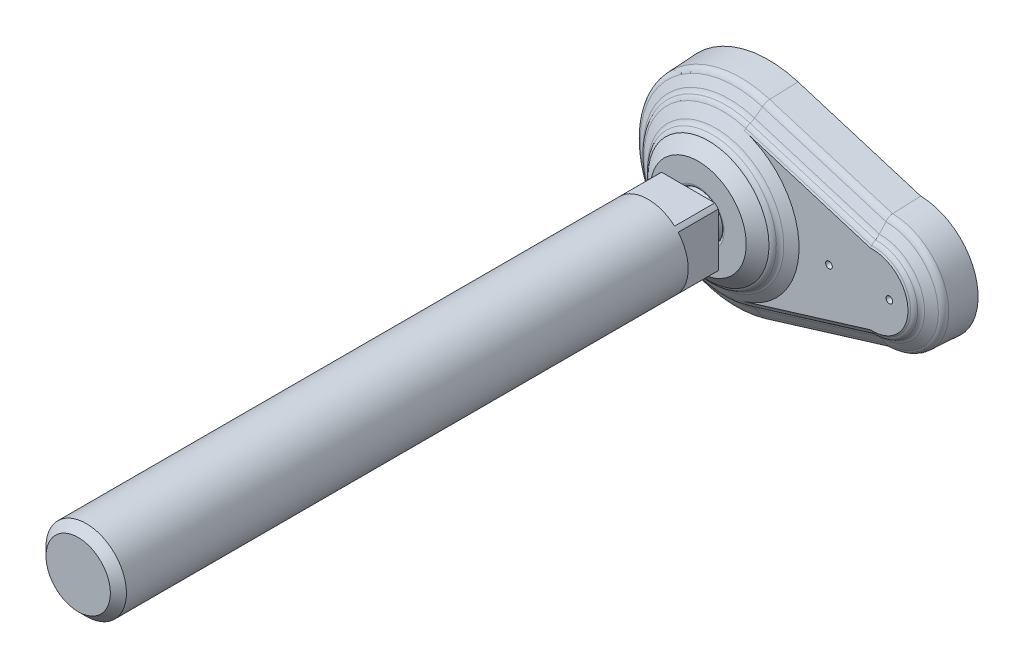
ISO-10303-21;
HEADER;
FILE_DESCRIPTION(('STEP AP214'),'2;1');
FILE_NAME('part.step','',(''),(''),'','','');
FILE_SCHEMA(('AUTOMOTIVE_DESIGN { 1 0 10303 214 1 1 1 1 }'));
ENDSEC;
DATA;
#1=APPLICATION_CONTEXT('core data for automotive mechanical design processes');
#2=APPLICATION_PROTOCOL_DEFINITION('international standard','automotive_design',2000,#1);
#3=PRODUCT_CONTEXT('',#1,'mechanical');
#4=PRODUCT('Part','Part','',(#3));
#5=PRODUCT_RELATED_PRODUCT_CATEGORY('part','',(#4));
#6=PRODUCT_DEFINITION_FORMATION('','',#4);
#7=PRODUCT_DEFINITION_CONTEXT('part definition',#1,'design');
#8=PRODUCT_DEFINITION('design','',#6,#7);
#9=PRODUCT_DEFINITION_SHAPE('','',#8);
#10=(LENGTH_UNIT() NAMED_UNIT(*) SI_UNIT(.MILLI.,.METRE.));
#11=(NAMED_UNIT(*) PLANE_ANGLE_UNIT() SI_UNIT($,.RADIAN.));
#12=(NAMED_UNIT(*) SI_UNIT($,.STERADIAN.) SOLID_ANGLE_UNIT());
#13=UNCERTAINTY_MEASURE_WITH_UNIT(LENGTH_MEASURE(1.E-05),#10,'distance_accuracy_value','');
#14=(GEOMETRIC_REPRESENTATION_CONTEXT(3) GLOBAL_UNCERTAINTY_ASSIGNED_CONTEXT((#13)) GLOBAL_UNIT_ASSIGNED_CONTEXT((#10,
#11,#12)) REPRESENTATION_CONTEXT('',''));
#15=CARTESIAN_POINT('',(0.,0.,0.));
#16=DIRECTION('',(0.,0.,1.));
#17=DIRECTION('',(1.,0.,0.));
#18=AXIS2_PLACEMENT_3D('',#15,#16,#17);
#19=CARTESIAN_POINT('',(0.,0.,36.));
#20=DIRECTION('',(0.,0.,1.));
#21=DIRECTION('',(-1.,0.,0.));
#22=AXIS2_PLACEMENT_3D('',#19,#20,#21);
#23=CYLINDRICAL_SURFACE('',#22,12.);
#24=CARTESIAN_POINT('',(0.,0.,203.6));
#25=DIRECTION('',(0.,0.,1.));
#26=DIRECTION('',(-1.,0.,0.));
#27=AXIS2_PLACEMENT_3D('',#24,#25,#26);
#28=CIRCLE('',#27,12.);
#29=CARTESIAN_POINT('',(-12.,0.,203.6));
#30=VERTEX_POINT('',#29);
#31=EDGE_CURVE('E9',#30,#30,#28,.F.);
#32=ORIENTED_EDGE('',*,*,#31,.T.);
#33=EDGE_LOOP('',(#32));
#34=FACE_BOUND('',#33,.T.);
#35=DIRECTION('',(0.,0.,1.));
#36=VECTOR('',#35,1.);
#37=CARTESIAN_POINT('',(-7.93725393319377,-9.,36.));
#38=LINE('',#37,#36);
#39=CARTESIAN_POINT('',(-7.93725393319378,-9.,36.));
#40=VERTEX_POINT('',#39);
#41=CARTESIAN_POINT('',(-7.93725393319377,-9.,24.));
#42=VERTEX_POINT('',#41);
#43=EDGE_CURVE('E136',#40,#42,#38,.F.);
#44=ORIENTED_EDGE('',*,*,#43,.F.);
#45=CARTESIAN_POINT('',(0.,0.,36.));
#46=DIRECTION('',(0.,0.,1.));
#47=DIRECTION('',(0.,-1.,0.));
#48=AXIS2_PLACEMENT_3D('',#45,#46,#47);
#49=CIRCLE('',#48,12.);
#50=CARTESIAN_POINT('',(7.93725393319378,-9.,36.));
#51=VERTEX_POINT('',#50);
#52=EDGE_CURVE('E598',#40,#51,#49,.T.);
#53=ORIENTED_EDGE('',*,*,#52,.T.);
#54=DIRECTION('',(0.,0.,1.));
#55=VECTOR('',#54,1.);
#56=CARTESIAN_POINT('',(7.93725393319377,-9.,36.));
#57=LINE('',#56,#55);
#58=CARTESIAN_POINT('',(7.93725393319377,-9.,24.));
#59=VERTEX_POINT('',#58);
#60=EDGE_CURVE('E201',#59,#51,#57,.T.);
#61=ORIENTED_EDGE('',*,*,#60,.F.);
#62=CARTESIAN_POINT('',(0.,0.,24.));
#63=DIRECTION('',(0.,0.,1.));
#64=DIRECTION('',(-1.,0.,0.));
#65=AXIS2_PLACEMENT_3D('',#62,#63,#64);
#66=CIRCLE('',#65,12.);
#67=CARTESIAN_POINT('',(9.,-7.93725393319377,24.));
#68=VERTEX_POINT('',#67);
#69=EDGE_CURVE('E184',#59,#68,#66,.T.);
#70=ORIENTED_EDGE('',*,*,#69,.T.);
#71=DIRECTION('',(0.,0.,1.));
#72=VECTOR('',#71,1.);
#73=CARTESIAN_POINT('',(9.,-7.93725393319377,36.));
#74=LINE('',#73,#72);
#75=CARTESIAN_POINT('',(9.,-7.93725393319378,36.));
#76=VERTEX_POINT('',#75);
#77=EDGE_CURVE('E198',#76,#68,#74,.F.);
#78=ORIENTED_EDGE('',*,*,#77,.F.);
#79=CARTESIAN_POINT('',(9.,7.93725393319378,36.));
#80=VERTEX_POINT('',#79);
#81=EDGE_CURVE('E266',#76,#80,#49,.T.);
#82=ORIENTED_EDGE('',*,*,#81,.T.);
#83=DIRECTION('',(0.,0.,1.));
#84=VECTOR('',#83,1.);
#85=CARTESIAN_POINT('',(9.,7.93725393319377,36.));
#86=LINE('',#85,#84);
#87=CARTESIAN_POINT('',(9.,7.93725393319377,24.));
#88=VERTEX_POINT('',#87);
#89=EDGE_CURVE('E243',#88,#80,#86,.T.);
#90=ORIENTED_EDGE('',*,*,#89,.F.);
#91=CARTESIAN_POINT('',(7.93725393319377,9.,24.));
#92=VERTEX_POINT('',#91);
#93=EDGE_CURVE('E180',#88,#92,#66,.T.);
#94=ORIENTED_EDGE('',*,*,#93,.T.);
#95=DIRECTION('',(0.,0.,1.));
#96=VECTOR('',#95,1.);
#97=CARTESIAN_POINT('',(7.93725393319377,9.,36.));
#98=LINE('',#97,#96);
#99=CARTESIAN_POINT('',(7.93725393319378,9.,36.));
#100=VERTEX_POINT('',#99);
#101=EDGE_CURVE('E161',#100,#92,#98,.F.);
#102=ORIENTED_EDGE('',*,*,#101,.F.);
#103=CARTESIAN_POINT('',(-7.93725393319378,9.,36.));
#104=VERTEX_POINT('',#103);
#105=EDGE_CURVE('E174',#100,#104,#49,.T.);
#106=ORIENTED_EDGE('',*,*,#105,.T.);
#107=DIRECTION('',(0.,0.,1.));
#108=VECTOR('',#107,1.);
#109=CARTESIAN_POINT('',(-7.93725393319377,9.,36.));
#110=LINE('',#109,#108);
#111=CARTESIAN_POINT('',(-7.93725393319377,9.,24.));
#112=VERTEX_POINT('',#111);
#113=EDGE_CURVE('E159',#112,#104,#110,.T.);
#114=ORIENTED_EDGE('',*,*,#113,.F.);
#115=CARTESIAN_POINT('',(-9.,7.93725393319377,24.));
#116=VERTEX_POINT('',#115);
#117=EDGE_CURVE('E172',#112,#116,#66,.T.);
#118=ORIENTED_EDGE('',*,*,#117,.T.);
#119=DIRECTION('',(0.,0.,1.));
#120=VECTOR('',#119,1.);
#121=CARTESIAN_POINT('',(-9.,7.93725393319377,36.));
#122=LINE('',#121,#120);
#123=CARTESIAN_POINT('',(-9.,7.93725393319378,36.));
#124=VERTEX_POINT('',#123);
#125=EDGE_CURVE('E175',#124,#116,#122,.F.);
#126=ORIENTED_EDGE('',*,*,#125,.F.);
#127=CARTESIAN_POINT('',(-9.,-7.93725393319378,36.));
#128=VERTEX_POINT('',#127);
#129=EDGE_CURVE('E599',#124,#128,#49,.T.);
#130=ORIENTED_EDGE('',*,*,#129,.T.);
#131=DIRECTION('',(0.,0.,1.));
#132=VECTOR('',#131,1.);
#133=CARTESIAN_POINT('',(-9.,-7.93725393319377,36.));
#134=LINE('',#133,#132);
#135=CARTESIAN_POINT('',(-9.,-7.93725393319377,24.));
#136=VERTEX_POINT('',#135);
#137=EDGE_CURVE('E181',#136,#128,#134,.T.);
#138=ORIENTED_EDGE('',*,*,#137,.F.);
#139=EDGE_CURVE('E183',#136,#42,#66,.T.);
#140=ORIENTED_EDGE('',*,*,#139,.T.);
#141=EDGE_LOOP('',(#44,#53,#61,#70,#78,#82,#90,#94,#102,#106,#114,#118,#126,#130,#138,#140));
#142=FACE_BOUND('',#141,.T.);
#143=ADVANCED_FACE('F14',(#34,#142),#23,.T.);
#144=CARTESIAN_POINT('',(-5.24903501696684,0.,24.));
#145=DIRECTION('',(0.,0.,1.));
#146=DIRECTION('',(-1.,0.,0.));
#147=AXIS2_PLACEMENT_3D('',#144,#145,#146);
#148=PLANE('',#147);
#149=DIRECTION('',(0.,-1.,0.));
#150=VECTOR('',#149,1.);
#151=CARTESIAN_POINT('',(-9.,9.,24.));
#152=LINE('',#151,#150);
#153=EDGE_CURVE('E31',#116,#136,#152,.T.);
#154=ORIENTED_EDGE('',*,*,#153,.F.);
#155=ORIENTED_EDGE('',*,*,#117,.F.);
#156=DIRECTION('',(-1.,0.,0.));
#157=VECTOR('',#156,1.);
#158=CARTESIAN_POINT('',(9.,9.,24.));
#159=LINE('',#158,#157);
#160=EDGE_CURVE('E154',#92,#112,#159,.T.);
#161=ORIENTED_EDGE('',*,*,#160,.F.);
#162=ORIENTED_EDGE('',*,*,#93,.F.);
#163=DIRECTION('',(0.,1.,0.));
#164=VECTOR('',#163,1.);
#165=CARTESIAN_POINT('',(9.,-9.,24.));
#166=LINE('',#165,#164);
#167=EDGE_CURVE('E166',#68,#88,#166,.T.);
#168=ORIENTED_EDGE('',*,*,#167,.F.);
#169=ORIENTED_EDGE('',*,*,#69,.F.);
#170=DIRECTION('',(1.,0.,0.));
#171=VECTOR('',#170,1.);
#172=CARTESIAN_POINT('',(-9.,-9.,24.));
#173=LINE('',#172,#171);
#174=EDGE_CURVE('E203',#42,#59,#173,.T.);
#175=ORIENTED_EDGE('',*,*,#174,.F.);
#176=ORIENTED_EDGE('',*,*,#139,.F.);
#177=EDGE_LOOP('',(#154,#155,#161,#162,#168,#169,#175,#176));
#178=FACE_BOUND('',#177,.T.);
#179=CARTESIAN_POINT('',(0.,0.,24.));
#180=DIRECTION('',(0.,0.,1.));
#181=DIRECTION('',(-1.,0.,0.));
#182=AXIS2_PLACEMENT_3D('',#179,#180,#181);
#183=CIRCLE('',#182,5.24903501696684);
#184=CARTESIAN_POINT('',(-5.24903501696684,0.,24.));
#185=VERTEX_POINT('',#184);
#186=EDGE_CURVE('E189',#185,#185,#183,.T.);
#187=ORIENTED_EDGE('',*,*,#186,.T.);
#188=EDGE_LOOP('',(#187));
#189=FACE_BOUND('',#188,.T.);
#190=ADVANCED_FACE('F177',(#178,#189),#148,.F.);
#191=CARTESIAN_POINT('',(0.,0.,17.6309999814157));
#192=DIRECTION('',(0.,0.,1.));
#193=DIRECTION('',(-1.,0.,0.));
#194=AXIS2_PLACEMENT_3D('',#191,#192,#193);
#195=DEGENERATE_TOROIDAL_SURFACE('',#194,0.0005038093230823,6.829,.T.);
#196=CARTESIAN_POINT('',(0.,0.,18.775));
#197=DIRECTION('',(0.,0.,-1.));
#198=DIRECTION('',(1.,0.,0.));
#199=AXIS2_PLACEMENT_3D('',#196,#197,#198);
#200=CIRCLE('',#199,6.733);
#201=CARTESIAN_POINT('',(6.733,0.,18.775));
#202=VERTEX_POINT('',#201);
#203=EDGE_CURVE('E250',#202,#202,#200,.T.);
#204=ORIENTED_EDGE('',*,*,#203,.F.);
#205=EDGE_LOOP('',(#204));
#206=FACE_BOUND('',#205,.T.);
#207=CARTESIAN_POINT('',(0.,0.,22.));
#208=DIRECTION('',(0.,0.,1.));
#209=DIRECTION('',(-1.,0.,0.));
#210=AXIS2_PLACEMENT_3D('',#207,#208,#209);
#211=CIRCLE('',#210,5.24903501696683);
#212=CARTESIAN_POINT('',(-5.24903501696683,0.,22.));
#213=VERTEX_POINT('',#212);
#214=EDGE_CURVE('E191',#213,#213,#211,.T.);
#215=ORIENTED_EDGE('',*,*,#214,.F.);
#216=EDGE_LOOP('',(#215));
#217=FACE_BOUND('',#216,.T.);
#218=ADVANCED_FACE('F472',(#206,#217),#195,.T.);
#219=CARTESIAN_POINT('',(0.,0.,36.));
#220=DIRECTION('',(0.,0.,1.));
#221=DIRECTION('',(-1.,0.,0.));
#222=AXIS2_PLACEMENT_3D('',#219,#220,#221);
#223=CYLINDRICAL_SURFACE('',#222,5.24903501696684);
#224=ORIENTED_EDGE('',*,*,#186,.F.);
#225=EDGE_LOOP('',(#224));
#226=FACE_BOUND('',#225,.T.);
#227=ORIENTED_EDGE('',*,*,#214,.T.);
#228=EDGE_LOOP('',(#227));
#229=FACE_BOUND('',#228,.T.);
#230=ADVANCED_FACE('F574',(#226,#229),#223,.T.);
#231=CARTESIAN_POINT('',(-9.,-9.,24.));
#232=DIRECTION('',(0.,-1.,0.));
#233=DIRECTION('',(1.,0.,0.));
#234=AXIS2_PLACEMENT_3D('',#231,#232,#233);
#235=PLANE('',#234);
#236=ORIENTED_EDGE('',*,*,#60,.T.);
#237=DIRECTION('',(-1.,0.,0.));
#238=VECTOR('',#237,1.);
#239=CARTESIAN_POINT('',(-12.,-9.,36.));
#240=LINE('',#239,#238);
#241=EDGE_CURVE('E215',#51,#40,#240,.T.);
#242=ORIENTED_EDGE('',*,*,#241,.T.);
#243=ORIENTED_EDGE('',*,*,#43,.T.);
#244=ORIENTED_EDGE('',*,*,#174,.T.);
#245=EDGE_LOOP('',(#236,#242,#243,#244));
#246=FACE_BOUND('',#245,.T.);
#247=ADVANCED_FACE('F572',(#246),#235,.T.);
#248=CARTESIAN_POINT('',(9.,-9.,24.));
#249=DIRECTION('',(1.,0.,0.));
#250=DIRECTION('',(0.,1.,0.));
#251=AXIS2_PLACEMENT_3D('',#248,#249,#250);
#252=PLANE('',#251);
#253=ORIENTED_EDGE('',*,*,#89,.T.);
#254=DIRECTION('',(0.,-1.,0.));
#255=VECTOR('',#254,1.);
#256=CARTESIAN_POINT('',(9.,0.,36.));
#257=LINE('',#256,#255);
#258=EDGE_CURVE('E222',#80,#76,#257,.T.);
#259=ORIENTED_EDGE('',*,*,#258,.T.);
#260=ORIENTED_EDGE('',*,*,#77,.T.);
#261=ORIENTED_EDGE('',*,*,#167,.T.);
#262=EDGE_LOOP('',(#253,#259,#260,#261));
#263=FACE_BOUND('',#262,.T.);
#264=ADVANCED_FACE('F568',(#263),#252,.T.);
#265=CARTESIAN_POINT('',(9.,9.,24.));
#266=DIRECTION('',(0.,1.,0.));
#267=DIRECTION('',(-1.,0.,0.));
#268=AXIS2_PLACEMENT_3D('',#265,#266,#267);
#269=PLANE('',#268);
#270=ORIENTED_EDGE('',*,*,#113,.T.);
#271=DIRECTION('',(1.,0.,0.));
#272=VECTOR('',#271,1.);
#273=CARTESIAN_POINT('',(-12.,9.,36.));
#274=LINE('',#273,#272);
#275=EDGE_CURVE('E226',#104,#100,#274,.T.);
#276=ORIENTED_EDGE('',*,*,#275,.T.);
#277=ORIENTED_EDGE('',*,*,#101,.T.);
#278=ORIENTED_EDGE('',*,*,#160,.T.);
#279=EDGE_LOOP('',(#270,#276,#277,#278));
#280=FACE_BOUND('',#279,.T.);
#281=ADVANCED_FACE('F156',(#280),#269,.T.);
#282=CARTESIAN_POINT('',(-9.,9.,24.));
#283=DIRECTION('',(-1.,0.,0.));
#284=DIRECTION('',(0.,-1.,0.));
#285=AXIS2_PLACEMENT_3D('',#282,#283,#284);
#286=PLANE('',#285);
#287=ORIENTED_EDGE('',*,*,#137,.T.);
#288=DIRECTION('',(0.,1.,0.));
#289=VECTOR('',#288,1.);
#290=CARTESIAN_POINT('',(-9.,0.,36.));
#291=LINE('',#290,#289);
#292=EDGE_CURVE('E239',#128,#124,#291,.T.);
#293=ORIENTED_EDGE('',*,*,#292,.T.);
#294=ORIENTED_EDGE('',*,*,#125,.T.);
#295=ORIENTED_EDGE('',*,*,#153,.T.);
#296=EDGE_LOOP('',(#287,#293,#294,#295));
#297=FACE_BOUND('',#296,.T.);
#298=ADVANCED_FACE('F482',(#297),#286,.T.);
#299=CARTESIAN_POINT('',(45.,0.,0.));
#300=DIRECTION('',(0.,0.,-1.));
#301=DIRECTION('',(0.,1.,0.));
#302=AXIS2_PLACEMENT_3D('',#299,#300,#301);
#303=CONICAL_SURFACE('',#302,17.5,0.0523365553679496);
#304=CARTESIAN_POINT('',(45.,0.,8.304));
#305=DIRECTION('',(0.,0.,1.));
#306=DIRECTION('',(0.,-1.,0.));
#307=AXIS2_PLACEMENT_3D('',#304,#305,#306);
#308=CIRCLE('',#307,17.065);
#309=CARTESIAN_POINT('',(45.3136024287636,-17.0621182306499,8.304));
#310=VERTEX_POINT('',#309);
#311=CARTESIAN_POINT('',(45.3136024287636,17.0621182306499,8.304));
#312=VERTEX_POINT('',#311);
#313=EDGE_CURVE('E304',#310,#312,#308,.T.);
#314=ORIENTED_EDGE('',*,*,#313,.F.);
#315=CARTESIAN_POINT('',(45.3136007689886,-17.0621077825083,8.3042));
#316=CARTESIAN_POINT('',(45.3250873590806,-17.134412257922,6.92013380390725));
#317=CARTESIAN_POINT('',(45.3366049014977,-17.206707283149,5.5360673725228));
#318=CARTESIAN_POINT('',(45.3597018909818,-17.3512784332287,2.76793403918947));
#319=CARTESIAN_POINT('',(45.3712813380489,-17.4235545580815,1.38386713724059));
#320=CARTESIAN_POINT('',(45.3828917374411,-17.4958212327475,-0.000200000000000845));
#321=B_SPLINE_CURVE_WITH_KNOTS('',3,(#315,#316,#317,#318,#319,#320),.UNSPECIFIED.,.F.,.F.,(4,2,
4),(0.,4.15800336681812,8.31600673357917),.UNSPECIFIED.);
#322=CARTESIAN_POINT('',(45.3828900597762,-17.4958107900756,0.));
#323=VERTEX_POINT('',#322);
#324=EDGE_CURVE('E949',#310,#323,#321,.T.);
#325=ORIENTED_EDGE('',*,*,#324,.T.);
#326=CARTESIAN_POINT('',(45.,0.,0.));
#327=DIRECTION('',(0.,0.,1.));
#328=DIRECTION('',(0.,-1.,0.));
#329=AXIS2_PLACEMENT_3D('',#326,#327,#328);
#330=CIRCLE('',#329,17.5);
#331=CARTESIAN_POINT('',(45.3828900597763,17.4958107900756,0.));
#332=VERTEX_POINT('',#331);
#333=EDGE_CURVE('E307',#323,#332,#330,.T.);
#334=ORIENTED_EDGE('',*,*,#333,.T.);
#335=CARTESIAN_POINT('',(45.3828917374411,17.4958212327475,-0.000200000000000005));
#336=CARTESIAN_POINT('',(45.371281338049,17.4235545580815,1.38386713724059));
#337=CARTESIAN_POINT('',(45.359701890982,17.3512784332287,2.76793403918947));
#338=CARTESIAN_POINT('',(45.3366049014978,17.206707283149,5.5360673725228));
#339=CARTESIAN_POINT('',(45.3250873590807,17.134412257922,6.92013380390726));
#340=CARTESIAN_POINT('',(45.3136007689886,17.0621077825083,8.3042));
#341=B_SPLINE_CURVE_WITH_KNOTS('',3,(#335,#336,#337,#338,#339,#340),.UNSPECIFIED.,.F.,.F.,(4,2,
4),(0.,4.15800336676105,8.31600673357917),.UNSPECIFIED.);
#342=EDGE_CURVE('E942',#332,#312,#341,.T.);
#343=ORIENTED_EDGE('',*,*,#342,.T.);
#344=EDGE_LOOP('',(#314,#325,#334,#343));
#345=FACE_BOUND('',#344,.T.);
#346=ADVANCED_FACE('F362',(#345),#303,.T.);
#347=CARTESIAN_POINT('',(46.8961596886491,-16.5782819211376,8.304));
#348=DIRECTION('',(-0.291971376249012,0.9549953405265,-0.0523126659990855));
#349=DIRECTION('',(-0.956304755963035,-0.292371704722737,0.));
#350=AXIS2_PLACEMENT_3D('',#347,#348,#349);
#351=PLANE('',#350);
#352=ORIENTED_EDGE('',*,*,#324,.F.);
#353=DIRECTION('',(-0.956304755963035,-0.292371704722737,0.));
#354=VECTOR('',#353,1.);
#355=CARTESIAN_POINT('',(46.8961596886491,-16.5782819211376,8.304));
#356=LINE('',#355,#354);
#357=CARTESIAN_POINT('',(8.64396945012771,-28.2731501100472,8.304));
#358=VERTEX_POINT('',#357);
#359=EDGE_CURVE('E974',#310,#358,#356,.T.);
#360=ORIENTED_EDGE('',*,*,#359,.T.);
#361=DIRECTION('',(-0.0152947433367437,0.050026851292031,0.998630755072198));
#362=VECTOR('',#361,1.);
#363=CARTESIAN_POINT('',(8.7711511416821,-28.689142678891,0.));
#364=LINE('',#363,#362);
#365=CARTESIAN_POINT('',(8.7711511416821,-28.689142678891,0.));
#366=VERTEX_POINT('',#365);
#367=EDGE_CURVE('E987',#366,#358,#364,.T.);
#368=ORIENTED_EDGE('',*,*,#367,.F.);
#369=DIRECTION('',(-0.956304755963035,-0.292371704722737,0.));
#370=VECTOR('',#369,1.);
#371=CARTESIAN_POINT('',(47.0233413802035,-16.9942744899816,0.));
#372=LINE('',#371,#370);
#373=EDGE_CURVE('E127',#323,#366,#372,.T.);
#374=ORIENTED_EDGE('',*,*,#373,.F.);
#375=EDGE_LOOP('',(#352,#360,#368,#374));
#376=FACE_BOUND('',#375,.T.);
#377=ADVANCED_FACE('F468',(#376),#351,.F.);
#378=CARTESIAN_POINT('',(0.,0.,0.));
#379=DIRECTION('',(0.,0.,1.));
#380=DIRECTION('',(0.,-1.,0.));
#381=AXIS2_PLACEMENT_3D('',#378,#379,#380);
#382=PLANE('',#381);
#383=DIRECTION('',(-0.956304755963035,0.292371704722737,0.));
#384=VECTOR('',#383,1.);
#385=CARTESIAN_POINT('',(47.0233413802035,16.9942744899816,0.));
#386=LINE('',#385,#384);
#387=CARTESIAN_POINT('',(8.7711511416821,28.689142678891,0.));
#388=VERTEX_POINT('',#387);
#389=EDGE_CURVE('E972',#332,#388,#386,.T.);
#390=ORIENTED_EDGE('',*,*,#389,.F.);
#391=ORIENTED_EDGE('',*,*,#333,.F.);
#392=ORIENTED_EDGE('',*,*,#373,.T.);
#393=CARTESIAN_POINT('',(0.,0.,0.));
#394=DIRECTION('',(0.,0.,1.));
#395=DIRECTION('',(0.,-1.,0.));
#396=AXIS2_PLACEMENT_3D('',#393,#394,#395);
#397=CIRCLE('',#396,30.);
#398=EDGE_CURVE('E351',#388,#366,#397,.T.);
#399=ORIENTED_EDGE('',*,*,#398,.F.);
#400=EDGE_LOOP('',(#390,#391,#392,#399));
#401=FACE_BOUND('',#400,.T.);
#402=CARTESIAN_POINT('',(32.,0.,0.));
#403=DIRECTION('',(0.,0.,-1.));
#404=DIRECTION('',(0.,1.,0.));
#405=AXIS2_PLACEMENT_3D('',#402,#403,#404);
#406=CIRCLE('',#405,4.25);
#407=CARTESIAN_POINT('',(32.,4.25,0.));
#408=VERTEX_POINT('',#407);
#409=EDGE_CURVE('E600',#408,#408,#406,.T.);
#410=ORIENTED_EDGE('',*,*,#409,.F.);
#411=EDGE_LOOP('',(#410));
#412=FACE_BOUND('',#411,.T.);
#413=CARTESIAN_POINT('',(50.,0.,0.));
#414=DIRECTION('',(0.,0.,-1.));
#415=DIRECTION('',(0.,1.,0.));
#416=AXIS2_PLACEMENT_3D('',#413,#414,#415);
#417=CIRCLE('',#416,4.25);
#418=CARTESIAN_POINT('',(50.,4.25,0.));
#419=VERTEX_POINT('',#418);
#420=EDGE_CURVE('E603',#419,#419,#417,.T.);
#421=ORIENTED_EDGE('',*,*,#420,.F.);
#422=EDGE_LOOP('',(#421));
#423=FACE_BOUND('',#422,.T.);
#424=ADVANCED_FACE('F360',(#401,#412,#423),#382,.F.);
#425=CARTESIAN_POINT('',(47.0233413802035,16.9942744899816,0.));
#426=DIRECTION('',(-0.291971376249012,-0.9549953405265,-0.0523126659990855));
#427=DIRECTION('',(0.956304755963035,-0.292371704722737,0.));
#428=AXIS2_PLACEMENT_3D('',#425,#426,#427);
#429=PLANE('',#428);
#430=ORIENTED_EDGE('',*,*,#342,.F.);
#431=ORIENTED_EDGE('',*,*,#389,.T.);
#432=DIRECTION('',(-0.0152947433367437,-0.050026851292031,0.998630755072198));
#433=VECTOR('',#432,1.);
#434=CARTESIAN_POINT('',(8.7711511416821,28.689142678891,0.));
#435=LINE('',#434,#433);
#436=CARTESIAN_POINT('',(8.64396945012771,28.2731501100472,8.304));
#437=VERTEX_POINT('',#436);
#438=EDGE_CURVE('E1004',#388,#437,#435,.T.);
#439=ORIENTED_EDGE('',*,*,#438,.T.);
#440=DIRECTION('',(-0.956304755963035,0.292371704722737,0.));
#441=VECTOR('',#440,1.);
#442=CARTESIAN_POINT('',(46.8961596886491,16.5782819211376,8.304));
#443=LINE('',#442,#441);
#444=EDGE_CURVE('E970',#312,#437,#443,.T.);
#445=ORIENTED_EDGE('',*,*,#444,.F.);
#446=EDGE_LOOP('',(#430,#431,#439,#445));
#447=FACE_BOUND('',#446,.T.);
#448=ADVANCED_FACE('F438',(#447),#429,.F.);
#449=CARTESIAN_POINT('',(45.,0.,8.20868962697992));
#450=DIRECTION('',(0.,0.,1.));
#451=DIRECTION('',(0.,-1.,0.));
#452=AXIS2_PLACEMENT_3D('',#449,#450,#451);
#453=TOROIDAL_SURFACE('',#452,15.0672723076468,2.);
#454=CARTESIAN_POINT('',(45.313603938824,-17.062127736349,8.3038));
#455=CARTESIAN_POINT('',(45.3131828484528,-17.0594763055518,8.3596419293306));
#456=CARTESIAN_POINT('',(45.3123906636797,-17.0544900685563,8.41534315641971));
#457=CARTESIAN_POINT('',(45.3100724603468,-17.0398916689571,8.52611669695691));
#458=CARTESIAN_POINT('',(45.3085464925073,-17.0302798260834,8.5811890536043));
#459=CARTESIAN_POINT('',(45.3028875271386,-16.9946160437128,8.7447437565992));
#460=CARTESIAN_POINT('',(45.2976717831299,-16.9617253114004,8.85178061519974));
#461=CARTESIAN_POINT('',(45.284530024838,-16.8786837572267,9.05872519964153));
#462=CARTESIAN_POINT('',(45.2766032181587,-16.8285278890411,9.1586308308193));
#463=CARTESIAN_POINT('',(45.2583029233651,-16.7124179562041,9.34857034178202));
#464=CARTESIAN_POINT('',(45.24792931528,-16.6464631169,9.43860373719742));
#465=CARTESIAN_POINT('',(45.2250216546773,-16.5003240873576,9.60671335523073));
#466=CARTESIAN_POINT('',(45.2124772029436,-16.4200713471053,9.68472843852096));
#467=CARTESIAN_POINT('',(45.1856662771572,-16.2478592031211,9.8261370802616));
#468=CARTESIAN_POINT('',(45.1714009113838,-16.1559073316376,9.88953997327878));
#469=CARTESIAN_POINT('',(45.148748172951,-16.0092275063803,9.97356807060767));
#470=CARTESIAN_POINT('',(45.1408156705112,-15.957749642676,10.0001426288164));
#471=CARTESIAN_POINT('',(45.1246863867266,-15.8528232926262,10.0486569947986));
#472=CARTESIAN_POINT('',(45.1164901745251,-15.7993790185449,10.0706061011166));
#473=CARTESIAN_POINT('',(45.1081834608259,-15.7450737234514,10.0902));
#474=B_SPLINE_CURVE_WITH_KNOTS('',3,(#454,#455,#456,#457,#458,#459,#460,#461,#462,#463,#464,
#465,#466,#467,#468,#469,#470,#471,#472,#473),.UNSPECIFIED.,.F.,.F.,(4,2,2,2,2,2,2,2,2,4),(0.,
0.167615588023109,0.335219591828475,0.669784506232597,1.00444729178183,1.33912648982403,
1.67545571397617,2.01156948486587,2.1867983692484,2.36167155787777),.UNSPECIFIED.);
#475=CARTESIAN_POINT('',(45.108268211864,-15.7456277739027,10.09));
#476=VERTEX_POINT('',#475);
#477=EDGE_CURVE('E950',#310,#476,#474,.T.);
#478=ORIENTED_EDGE('',*,*,#477,.F.);
#479=ORIENTED_EDGE('',*,*,#313,.T.);
#480=CARTESIAN_POINT('',(45.1081834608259,15.7450737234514,10.0902));
#481=CARTESIAN_POINT('',(45.1162755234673,15.7979756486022,10.0711117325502));
#482=CARTESIAN_POINT('',(45.1242625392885,15.8500594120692,10.0497900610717));
#483=CARTESIAN_POINT('',(45.1399729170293,15.9522733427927,10.0028085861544));
#484=CARTESIAN_POINT('',(45.1476962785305,16.0024035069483,9.97714877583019));
#485=CARTESIAN_POINT('',(45.170371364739,16.1492634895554,9.89392549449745));
#486=CARTESIAN_POINT('',(45.1848488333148,16.2425982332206,9.83006921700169));
#487=CARTESIAN_POINT('',(45.2120467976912,16.4173167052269,9.6873614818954));
#488=CARTESIAN_POINT('',(45.2247661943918,16.4986929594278,9.60850071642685));
#489=CARTESIAN_POINT('',(45.2480269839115,16.647087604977,9.4379734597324));
#490=CARTESIAN_POINT('',(45.2585686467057,16.7141077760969,9.34630855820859));
#491=CARTESIAN_POINT('',(45.2770522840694,16.8313730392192,9.15345563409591));
#492=CARTESIAN_POINT('',(45.2850114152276,16.8817288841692,9.05233645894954));
#493=CARTESIAN_POINT('',(45.298151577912,16.9647535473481,8.84294631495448));
#494=CARTESIAN_POINT('',(45.3033350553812,16.9974379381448,8.73468173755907));
#495=CARTESIAN_POINT('',(45.3088197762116,17.0320013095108,8.57167924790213));
#496=CARTESIAN_POINT('',(45.3102579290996,17.0410597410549,8.51840996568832));
#497=CARTESIAN_POINT('',(45.3124461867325,17.0548396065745,8.41140374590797));
#498=CARTESIAN_POINT('',(45.3131976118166,17.0595693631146,8.35766790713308));
#499=CARTESIAN_POINT('',(45.313603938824,17.062127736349,8.3038));
#500=B_SPLINE_CURVE_WITH_KNOTS('',3,(#480,#481,#482,#483,#484,#485,#486,#487,#488,#489,#490,
#491,#492,#493,#494,#495,#496,#497,#498,#499),.UNSPECIFIED.,.F.,.F.,(4,2,2,2,2,2,2,2,2,4),(0.,
0.170355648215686,0.340711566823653,0.680992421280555,1.02148505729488,1.36193545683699,
1.70007548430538,2.03791704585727,2.19992239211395,2.36161559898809),.UNSPECIFIED.);
#501=CARTESIAN_POINT('',(45.1082682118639,15.7456277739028,10.09));
#502=VERTEX_POINT('',#501);
#503=EDGE_CURVE('E427',#502,#312,#500,.T.);
#504=ORIENTED_EDGE('',*,*,#503,.F.);
#505=CARTESIAN_POINT('',(45.,0.,10.09));
#506=DIRECTION('',(0.,0.,1.));
#507=DIRECTION('',(0.,-1.,0.));
#508=AXIS2_PLACEMENT_3D('',#505,#506,#507);
#509=CIRCLE('',#508,15.746);
#510=EDGE_CURVE('E301',#476,#502,#509,.T.);
#511=ORIENTED_EDGE('',*,*,#510,.F.);
#512=EDGE_LOOP('',(#478,#479,#504,#511));
#513=FACE_BOUND('',#512,.T.);
#514=ADVANCED_FACE('F411',(#513),#453,.T.);
#515=CARTESIAN_POINT('',(46.312080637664,-14.6678454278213,8.20868962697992));
#516=DIRECTION('',(-0.956304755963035,-0.292371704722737,0.));
#517=DIRECTION('',(0.292371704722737,-0.956304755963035,0.));
#518=AXIS2_PLACEMENT_3D('',#515,#516,#517);
#519=CYLINDRICAL_SURFACE('',#518,2.);
#520=ORIENTED_EDGE('',*,*,#359,.F.);
#521=ORIENTED_EDGE('',*,*,#477,.T.);
#522=DIRECTION('',(-0.956304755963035,-0.292371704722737,0.));
#523=VECTOR('',#522,1.);
#524=CARTESIAN_POINT('',(46.5105214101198,-15.3169159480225,10.09));
#525=LINE('',#524,#523);
#526=CARTESIAN_POINT('',(8.25833117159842,-27.0117841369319,10.09));
#527=VERTEX_POINT('',#526);
#528=EDGE_CURVE('E976',#476,#527,#525,.T.);
#529=ORIENTED_EDGE('',*,*,#528,.T.);
#530=CARTESIAN_POINT('',(8.05989039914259,-26.3627136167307,8.20868962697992));
#531=DIRECTION('',(0.956304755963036,0.292371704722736,0.));
#532=DIRECTION('',(-0.292371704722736,0.956304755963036,0.));
#533=AXIS2_PLACEMENT_3D('',#530,#531,#532);
#534=CIRCLE('',#533,2.);
#535=EDGE_CURVE('E990',#527,#358,#534,.T.);
#536=ORIENTED_EDGE('',*,*,#535,.T.);
#537=EDGE_LOOP('',(#520,#521,#529,#536));
#538=FACE_BOUND('',#537,.T.);
#539=ADVANCED_FACE('F439',(#538),#519,.T.);
#540=CARTESIAN_POINT('',(0.,0.,0.));
#541=DIRECTION('',(0.,0.,-1.));
#542=DIRECTION('',(0.,1.,0.));
#543=AXIS2_PLACEMENT_3D('',#540,#541,#542);
#544=CONICAL_SURFACE('',#543,30.,0.0523365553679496);
#545=CARTESIAN_POINT('',(0.,0.,8.304));
#546=DIRECTION('',(0.,0.,1.));
#547=DIRECTION('',(0.,-1.,0.));
#548=AXIS2_PLACEMENT_3D('',#545,#546,#547);
#549=CIRCLE('',#548,29.565);
#550=EDGE_CURVE('E1033',#437,#358,#549,.T.);
#551=ORIENTED_EDGE('',*,*,#550,.F.);
#552=ORIENTED_EDGE('',*,*,#438,.F.);
#553=ORIENTED_EDGE('',*,*,#398,.T.);
#554=ORIENTED_EDGE('',*,*,#367,.T.);
#555=EDGE_LOOP('',(#551,#552,#553,#554));
#556=FACE_BOUND('',#555,.T.);
#557=ADVANCED_FACE('F459',(#556),#544,.T.);
#558=CARTESIAN_POINT('',(46.312080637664,14.6678454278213,8.20868962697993));
#559=DIRECTION('',(-0.956304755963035,0.292371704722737,0.));
#560=DIRECTION('',(-0.292371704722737,-0.956304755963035,0.));
#561=AXIS2_PLACEMENT_3D('',#558,#559,#560);
#562=CYLINDRICAL_SURFACE('',#561,2.);
#563=DIRECTION('',(-0.956304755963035,0.292371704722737,0.));
#564=VECTOR('',#563,1.);
#565=CARTESIAN_POINT('',(46.5105214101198,15.3169159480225,10.09));
#566=LINE('',#565,#564);
#567=CARTESIAN_POINT('',(8.25833117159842,27.0117841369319,10.09));
#568=VERTEX_POINT('',#567);
#569=EDGE_CURVE('E968',#502,#568,#566,.T.);
#570=ORIENTED_EDGE('',*,*,#569,.F.);
#571=ORIENTED_EDGE('',*,*,#503,.T.);
#572=ORIENTED_EDGE('',*,*,#444,.T.);
#573=CARTESIAN_POINT('',(8.05989039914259,26.3627136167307,8.20868962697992));
#574=DIRECTION('',(-0.956304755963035,0.292371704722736,0.));
#575=DIRECTION('',(-0.292371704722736,-0.956304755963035,0.));
#576=AXIS2_PLACEMENT_3D('',#573,#574,#575);
#577=CIRCLE('',#576,2.);
#578=EDGE_CURVE('E1007',#568,#437,#577,.T.);
#579=ORIENTED_EDGE('',*,*,#578,.F.);
#580=EDGE_LOOP('',(#570,#571,#572,#579));
#581=FACE_BOUND('',#580,.T.);
#582=ADVANCED_FACE('F370',(#581),#562,.T.);
#583=CARTESIAN_POINT('',(45.,0.,10.09));
#584=DIRECTION('',(0.,0.,-1.));
#585=DIRECTION('',(0.,1.,0.));
#586=AXIS2_PLACEMENT_3D('',#583,#584,#585);
#587=CONICAL_SURFACE('',#586,15.746,0.993858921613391);
#588=CARTESIAN_POINT('',(45.,0.,11.7170000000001));
#589=DIRECTION('',(0.,0.,1.));
#590=DIRECTION('',(0.,-1.,0.));
#591=AXIS2_PLACEMENT_3D('',#588,#589,#590);
#592=CIRCLE('',#591,13.2459999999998);
#593=CARTESIAN_POINT('',(44.7416637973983,-13.243480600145,11.7170000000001));
#594=VERTEX_POINT('',#593);
#595=CARTESIAN_POINT('',(44.7416637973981,13.2434806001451,11.7170000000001));
#596=VERTEX_POINT('',#595);
#597=EDGE_CURVE('E299',#594,#596,#592,.T.);
#598=ORIENTED_EDGE('',*,*,#597,.F.);
#599=CARTESIAN_POINT('',(44.7416208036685,-13.2431723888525,11.7172000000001));
#600=CARTESIAN_POINT('',(44.8000092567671,-13.66082442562,11.4461588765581));
#601=CARTESIAN_POINT('',(44.8597613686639,-14.078214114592,11.1750215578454));
#602=CARTESIAN_POINT('',(44.9819928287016,-14.9124682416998,10.6325548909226));
#603=CARTESIAN_POINT('',(45.0444721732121,-15.3293326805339,10.3612255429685));
#604=CARTESIAN_POINT('',(45.1083151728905,-15.745934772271,10.0898));
#605=B_SPLINE_CURVE_WITH_KNOTS('',3,(#599,#600,#601,#602,#603,#604),.UNSPECIFIED.,.F.,.F.,(4,2,
4),(0.,1.50389468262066,3.0077873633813),.UNSPECIFIED.);
#606=EDGE_CURVE('E420',#594,#476,#605,.T.);
#607=ORIENTED_EDGE('',*,*,#606,.T.);
#608=ORIENTED_EDGE('',*,*,#510,.T.);
#609=CARTESIAN_POINT('',(45.1083151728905,15.745934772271,10.0898));
#610=CARTESIAN_POINT('',(45.0444721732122,15.3293326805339,10.3612255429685));
#611=CARTESIAN_POINT('',(44.9819928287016,14.9124682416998,10.6325548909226));
#612=CARTESIAN_POINT('',(44.8597613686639,14.078214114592,11.1750215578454));
#613=CARTESIAN_POINT('',(44.8000092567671,13.66082442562,11.4461588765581));
#614=CARTESIAN_POINT('',(44.7416208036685,13.2431723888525,11.7172000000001));
#615=B_SPLINE_CURVE_WITH_KNOTS('',3,(#609,#610,#611,#612,#613,#614),.UNSPECIFIED.,.F.,.F.,(4,2,
4),(0.,1.50389268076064,3.0077873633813),.UNSPECIFIED.);
#616=EDGE_CURVE('E414',#502,#596,#615,.T.);
#617=ORIENTED_EDGE('',*,*,#616,.T.);
#618=EDGE_LOOP('',(#598,#607,#608,#617));
#619=FACE_BOUND('',#618,.T.);
#620=ADVANCED_FACE('F405',(#619),#587,.T.);
#621=CARTESIAN_POINT('',(45.7795921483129,-12.9261540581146,11.7170000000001));
#622=DIRECTION('',(-0.159476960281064,0.521625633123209,-0.838137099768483));
#623=DIRECTION('',(0.,0.849002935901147,0.528388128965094));
#624=AXIS2_PLACEMENT_3D('',#621,#622,#623);
#625=PLANE('',#624);
#626=ORIENTED_EDGE('',*,*,#606,.F.);
#627=DIRECTION('',(-0.956304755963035,-0.292371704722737,0.));
#628=VECTOR('',#627,1.);
#629=CARTESIAN_POINT('',(45.7795921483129,-12.9261540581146,11.7170000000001));
#630=LINE('',#629,#628);
#631=CARTESIAN_POINT('',(7.52740190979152,-24.6210222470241,11.7170000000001));
#632=VERTEX_POINT('',#631);
#633=EDGE_CURVE('E978',#594,#632,#630,.T.);
#634=ORIENTED_EDGE('',*,*,#633,.T.);
#635=DIRECTION('',(-0.245047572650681,0.801514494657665,0.545459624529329));
#636=VECTOR('',#635,1.);
#637=CARTESIAN_POINT('',(8.25833117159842,-27.0117841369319,10.09));
#638=LINE('',#637,#636);
#639=EDGE_CURVE('E993',#527,#632,#638,.T.);
#640=ORIENTED_EDGE('',*,*,#639,.F.);
#641=ORIENTED_EDGE('',*,*,#528,.F.);
#642=EDGE_LOOP('',(#626,#634,#640,#641));
#643=FACE_BOUND('',#642,.T.);
#644=ADVANCED_FACE('F409',(#643),#625,.F.);
#645=CARTESIAN_POINT('',(0.,0.,8.20868962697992));
#646=DIRECTION('',(0.,0.,1.));
#647=DIRECTION('',(0.,-1.,0.));
#648=AXIS2_PLACEMENT_3D('',#645,#646,#647);
#649=TOROIDAL_SURFACE('',#648,27.5672723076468,2.);
#650=CARTESIAN_POINT('',(0.,0.,10.09));
#651=DIRECTION('',(0.,0.,1.));
#652=DIRECTION('',(0.,-1.,0.));
#653=AXIS2_PLACEMENT_3D('',#650,#651,#652);
#654=CIRCLE('',#653,28.246);
#655=EDGE_CURVE('E1031',#568,#527,#654,.T.);
#656=ORIENTED_EDGE('',*,*,#655,.F.);
#657=ORIENTED_EDGE('',*,*,#578,.T.);
#658=ORIENTED_EDGE('',*,*,#550,.T.);
#659=ORIENTED_EDGE('',*,*,#535,.F.);
#660=EDGE_LOOP('',(#656,#657,#658,#659));
#661=FACE_BOUND('',#660,.T.);
#662=ADVANCED_FACE('F436',(#661),#649,.T.);
#663=CARTESIAN_POINT('',(46.5105214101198,15.3169159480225,10.09));
#664=DIRECTION('',(-0.159476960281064,-0.521625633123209,-0.838137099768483));
#665=DIRECTION('',(0.,0.849002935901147,-0.528388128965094));
#666=AXIS2_PLACEMENT_3D('',#663,#664,#665);
#667=PLANE('',#666);
#668=ORIENTED_EDGE('',*,*,#616,.F.);
#669=ORIENTED_EDGE('',*,*,#569,.T.);
#670=DIRECTION('',(-0.245047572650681,-0.801514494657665,0.545459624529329));
#671=VECTOR('',#670,1.);
#672=CARTESIAN_POINT('',(8.25833117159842,27.0117841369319,10.09));
#673=LINE('',#672,#671);
#674=CARTESIAN_POINT('',(7.52740190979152,24.6210222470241,11.7170000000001));
#675=VERTEX_POINT('',#674);
#676=EDGE_CURVE('E1010',#568,#675,#673,.T.);
#677=ORIENTED_EDGE('',*,*,#676,.T.);
#678=DIRECTION('',(-0.956304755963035,0.292371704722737,0.));
#679=VECTOR('',#678,1.);
#680=CARTESIAN_POINT('',(45.7795921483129,12.9261540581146,11.7170000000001));
#681=LINE('',#680,#679);
#682=EDGE_CURVE('E966',#596,#675,#681,.T.);
#683=ORIENTED_EDGE('',*,*,#682,.F.);
#684=EDGE_LOOP('',(#668,#669,#677,#683));
#685=FACE_BOUND('',#684,.T.);
#686=ADVANCED_FACE('F376',(#685),#667,.F.);
#687=CARTESIAN_POINT('',(45.,0.,13.5975547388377));
#688=DIRECTION('',(0.,0.,1.));
#689=DIRECTION('',(0.,-1.,0.));
#690=AXIS2_PLACEMENT_3D('',#687,#688,#689);
#691=TOROIDAL_SURFACE('',#690,13.9471154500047,2.007);
#692=CARTESIAN_POINT('',(44.7417388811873,-13.2440188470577,11.7168000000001));
#693=CARTESIAN_POINT('',(44.7343279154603,-13.1908941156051,11.7365326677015));
#694=CARTESIAN_POINT('',(44.7270601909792,-13.1386083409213,11.7584983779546));
#695=CARTESIAN_POINT('',(44.7128498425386,-13.0360296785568,11.8067671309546));
#696=CARTESIAN_POINT('',(44.7059072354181,-12.9857368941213,11.8330703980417));
#697=CARTESIAN_POINT('',(44.6856140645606,-12.8382408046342,11.9183407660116));
#698=CARTESIAN_POINT('',(44.6728115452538,-12.7445159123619,11.9836326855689));
#699=CARTESIAN_POINT('',(44.6490134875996,-12.5692567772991,12.129233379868));
#700=CARTESIAN_POINT('',(44.6380196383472,-12.487733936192,12.2095560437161));
#701=CARTESIAN_POINT('',(44.6181322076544,-12.3395119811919,12.3828602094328));
#702=CARTESIAN_POINT('',(44.6092328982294,-12.2727724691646,12.4758060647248));
#703=CARTESIAN_POINT('',(44.5998238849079,-12.2019312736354,12.5946409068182));
#704=CARTESIAN_POINT('',(44.5982145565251,-12.1898023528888,12.6158623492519));
#705=CARTESIAN_POINT('',(44.5951037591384,-12.166336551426,12.6587196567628));
#706=CARTESIAN_POINT('',(44.5936021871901,-12.1549989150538,12.6803551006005));
#707=CARTESIAN_POINT('',(44.5921537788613,-12.1440536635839,12.7021999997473));
#708=B_SPLINE_CURVE_WITH_KNOTS('',3,(#692,#693,#694,#695,#696,#697,#698,#699,#700,#701,#702,
#703,#704,#705,#706,#707),.UNSPECIFIED.,.F.,.F.,(4,2,2,2,2,2,2,4),(0.,0.1713558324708,
0.34272053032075,0.685756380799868,1.02911079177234,1.37151502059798,1.44499468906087,
1.51840319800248),.UNSPECIFIED.);
#709=CARTESIAN_POINT('',(44.5921670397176,-12.1441538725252,12.7019999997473));
#710=VERTEX_POINT('',#709);
#711=EDGE_CURVE('E387',#594,#710,#708,.T.);
#712=ORIENTED_EDGE('',*,*,#711,.F.);
#713=ORIENTED_EDGE('',*,*,#597,.T.);
#714=CARTESIAN_POINT('',(44.5921537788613,12.1440536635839,12.7021999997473));
#715=CARTESIAN_POINT('',(44.5955092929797,12.1694097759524,12.6515877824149));
#716=CARTESIAN_POINT('',(44.5991523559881,12.1968896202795,12.602091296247));
#717=CARTESIAN_POINT('',(44.6069951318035,12.2559024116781,12.5056278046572));
#718=CARTESIAN_POINT('',(44.6111948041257,12.2874350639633,12.4586606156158));
#719=CARTESIAN_POINT('',(44.6245996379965,12.3878100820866,12.3220118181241));
#720=CARTESIAN_POINT('',(44.6346123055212,12.4624423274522,12.2365574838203));
#721=CARTESIAN_POINT('',(44.6565336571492,12.6247734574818,12.0794943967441));
#722=CARTESIAN_POINT('',(44.6684429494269,12.7124765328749,12.0078901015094));
#723=CARTESIAN_POINT('',(44.6938576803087,12.8983236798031,11.8805096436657));
#724=CARTESIAN_POINT('',(44.7073595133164,12.9964441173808,11.8246986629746));
#725=CARTESIAN_POINT('',(44.7247880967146,13.1221926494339,11.7664352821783));
#726=CARTESIAN_POINT('',(44.7281354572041,13.1463053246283,11.7558334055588));
#727=CARTESIAN_POINT('',(44.7348911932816,13.1948908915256,11.7355957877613));
#728=CARTESIAN_POINT('',(44.7382994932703,13.2193633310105,11.7259589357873));
#729=CARTESIAN_POINT('',(44.7417388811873,13.2440188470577,11.7168000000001));
#730=B_SPLINE_CURVE_WITH_KNOTS('',3,(#714,#715,#716,#717,#718,#719,#720,#721,#722,#723,#724,
#725,#726,#727,#728,#729),.UNSPECIFIED.,.F.,.F.,(4,2,2,2,2,2,2,4),(0.,0.170014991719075,
0.340017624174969,0.679938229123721,1.01996805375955,1.35924229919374,1.43888856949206,
1.51844208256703),.UNSPECIFIED.);
#731=CARTESIAN_POINT('',(44.5921670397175,12.1441538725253,12.7019999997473));
#732=VERTEX_POINT('',#731);
#733=EDGE_CURVE('E380',#732,#596,#730,.T.);
#734=ORIENTED_EDGE('',*,*,#733,.F.);
#735=CARTESIAN_POINT('',(45.,0.,12.7019999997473));
#736=DIRECTION('',(0.,0.,1.));
#737=DIRECTION('',(0.,-1.,0.));
#738=AXIS2_PLACEMENT_3D('',#735,#736,#737);
#739=CIRCLE('',#738,12.1510000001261);
#740=EDGE_CURVE('E297',#710,#732,#739,.T.);
#741=ORIENTED_EDGE('',*,*,#740,.F.);
#742=EDGE_LOOP('',(#712,#713,#734,#741));
#743=FACE_BOUND('',#742,.T.);
#744=ADVANCED_FACE('F399',(#743),#691,.F.);
#745=CARTESIAN_POINT('',(45.9845784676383,-13.5966340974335,13.5975547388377));
#746=DIRECTION('',(-0.956304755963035,-0.292371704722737,0.));
#747=DIRECTION('',(0.292371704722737,-0.956304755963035,0.));
#748=AXIS2_PLACEMENT_3D('',#745,#746,#747);
#749=CYLINDRICAL_SURFACE('',#748,2.007);
#750=ORIENTED_EDGE('',*,*,#633,.F.);
#751=ORIENTED_EDGE('',*,*,#711,.T.);
#752=DIRECTION('',(-0.956304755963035,-0.292371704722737,0.));
#753=VECTOR('',#752,1.);
#754=CARTESIAN_POINT('',(45.4594451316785,-11.8790003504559,12.7019999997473));
#755=LINE('',#754,#753);
#756=CARTESIAN_POINT('',(7.20725489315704,-23.5738685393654,12.7019999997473));
#757=VERTEX_POINT('',#756);
#758=EDGE_CURVE('E980',#710,#757,#755,.T.);
#759=ORIENTED_EDGE('',*,*,#758,.T.);
#760=CARTESIAN_POINT('',(7.7323882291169,-25.291502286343,13.5975547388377));
#761=DIRECTION('',(0.956304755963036,0.292371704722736,0.));
#762=DIRECTION('',(-0.292371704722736,0.956304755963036,0.));
#763=AXIS2_PLACEMENT_3D('',#760,#761,#762);
#764=CIRCLE('',#763,2.007);
#765=EDGE_CURVE('E996',#632,#757,#764,.T.);
#766=ORIENTED_EDGE('',*,*,#765,.F.);
#767=EDGE_LOOP('',(#750,#751,#759,#766));
#768=FACE_BOUND('',#767,.T.);
#769=ADVANCED_FACE('F403',(#768),#749,.F.);
#770=CARTESIAN_POINT('',(0.,0.,10.09));
#771=DIRECTION('',(0.,0.,-1.));
#772=DIRECTION('',(0.,1.,0.));
#773=AXIS2_PLACEMENT_3D('',#770,#771,#772);
#774=CONICAL_SURFACE('',#773,28.246,0.993858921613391);
#775=CARTESIAN_POINT('',(0.,0.,11.7170000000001));
#776=DIRECTION('',(0.,0.,1.));
#777=DIRECTION('',(0.,-1.,0.));
#778=AXIS2_PLACEMENT_3D('',#775,#776,#777);
#779=CIRCLE('',#778,25.746);
#780=EDGE_CURVE('E1028',#675,#632,#779,.T.);
#781=ORIENTED_EDGE('',*,*,#780,.F.);
#782=ORIENTED_EDGE('',*,*,#676,.F.);
#783=ORIENTED_EDGE('',*,*,#655,.T.);
#784=ORIENTED_EDGE('',*,*,#639,.T.);
#785=EDGE_LOOP('',(#781,#782,#783,#784));
#786=FACE_BOUND('',#785,.T.);
#787=ADVANCED_FACE('F374',(#786),#774,.T.);
#788=CARTESIAN_POINT('',(45.9845784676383,13.5966340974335,13.5975547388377));
#789=DIRECTION('',(-0.956304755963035,0.292371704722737,0.));
#790=DIRECTION('',(-0.292371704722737,-0.956304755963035,0.));
#791=AXIS2_PLACEMENT_3D('',#788,#789,#790);
#792=CYLINDRICAL_SURFACE('',#791,2.007);
#793=DIRECTION('',(-0.956304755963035,0.292371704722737,0.));
#794=VECTOR('',#793,1.);
#795=CARTESIAN_POINT('',(45.4594451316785,11.8790003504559,12.7019999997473));
#796=LINE('',#795,#794);
#797=CARTESIAN_POINT('',(7.20725489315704,23.5738685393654,12.7019999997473));
#798=VERTEX_POINT('',#797);
#799=EDGE_CURVE('E964',#732,#798,#796,.T.);
#800=ORIENTED_EDGE('',*,*,#799,.F.);
#801=ORIENTED_EDGE('',*,*,#733,.T.);
#802=ORIENTED_EDGE('',*,*,#682,.T.);
#803=CARTESIAN_POINT('',(7.7323882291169,25.291502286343,13.5975547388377));
#804=DIRECTION('',(-0.956304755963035,0.292371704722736,0.));
#805=DIRECTION('',(-0.292371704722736,-0.956304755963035,0.));
#806=AXIS2_PLACEMENT_3D('',#803,#804,#805);
#807=CIRCLE('',#806,2.007);
#808=EDGE_CURVE('E1013',#675,#798,#807,.T.);
#809=ORIENTED_EDGE('',*,*,#808,.T.);
#810=EDGE_LOOP('',(#800,#801,#802,#809));
#811=FACE_BOUND('',#810,.T.);
#812=ADVANCED_FACE('F361',(#811),#792,.F.);
#813=CARTESIAN_POINT('',(45.,0.,11.8059878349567));
#814=DIRECTION('',(0.,0.,1.));
#815=DIRECTION('',(0.,-1.,0.));
#816=AXIS2_PLACEMENT_3D('',#813,#814,#815);
#817=TOROIDAL_SURFACE('',#816,10.3551126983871,2.007);
#818=CARTESIAN_POINT('',(44.5921803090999,-12.1442541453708,12.7017999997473));
#819=CARTESIAN_POINT('',(44.5888264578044,-12.1189091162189,12.7523579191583));
#820=CARTESIAN_POINT('',(44.5851980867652,-12.0914410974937,12.8018007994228));
#821=CARTESIAN_POINT('',(44.5774254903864,-12.0324505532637,12.8981580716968));
#822=CARTESIAN_POINT('',(44.5732813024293,-12.0009283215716,12.9450726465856));
#823=CARTESIAN_POINT('',(44.5601271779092,-11.900585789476,13.0815540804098));
#824=CARTESIAN_POINT('',(44.5503931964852,-11.8259709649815,13.166895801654));
#825=CARTESIAN_POINT('',(44.5293734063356,-11.6636453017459,13.3237420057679));
#826=CARTESIAN_POINT('',(44.5180870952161,-11.5759302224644,13.3952419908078));
#827=CARTESIAN_POINT('',(44.4943743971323,-11.3900195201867,13.5224423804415));
#828=CARTESIAN_POINT('',(44.4819505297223,-11.2918469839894,13.5781766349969));
#829=CARTESIAN_POINT('',(44.4661159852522,-11.1654767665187,13.6366284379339));
#830=CARTESIAN_POINT('',(44.4630317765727,-11.1408064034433,13.6474450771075));
#831=CARTESIAN_POINT('',(44.4568308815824,-11.0910877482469,13.668072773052));
#832=CARTESIAN_POINT('',(44.4537142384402,-11.0660399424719,13.6778850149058));
#833=CARTESIAN_POINT('',(44.4505813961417,-11.0408004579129,13.6872));
#834=B_SPLINE_CURVE_WITH_KNOTS('',3,(#818,#819,#820,#821,#822,#823,#824,#825,#826,#827,#828,
#829,#830,#831,#832,#833),.UNSPECIFIED.,.F.,.F.,(4,2,2,2,2,2,2,4),(0.,0.169854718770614,
0.339697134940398,0.679258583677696,1.01893018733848,1.35786686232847,1.43919562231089,
1.52042728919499),.UNSPECIFIED.);
#835=CARTESIAN_POINT('',(44.4506486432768,-11.0413422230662,13.687));
#836=VERTEX_POINT('',#835);
#837=EDGE_CURVE('E388',#710,#836,#834,.T.);
#838=ORIENTED_EDGE('',*,*,#837,.F.);
#839=ORIENTED_EDGE('',*,*,#740,.T.);
#840=CARTESIAN_POINT('',(44.4505813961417,11.0408004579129,13.6872));
#841=CARTESIAN_POINT('',(44.4571923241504,11.0940621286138,13.6675450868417));
#842=CARTESIAN_POINT('',(44.4637328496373,11.1464811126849,13.64566148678));
#843=CARTESIAN_POINT('',(44.4766250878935,11.2493192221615,13.5975597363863));
#844=CARTESIAN_POINT('',(44.4829767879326,11.2997382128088,13.5713412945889));
#845=CARTESIAN_POINT('',(44.5016867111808,11.4476029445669,13.4863205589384));
#846=CARTESIAN_POINT('',(44.5136874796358,11.5415577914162,13.421189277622));
#847=CARTESIAN_POINT('',(44.5362881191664,11.7172436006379,13.2758674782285));
#848=CARTESIAN_POINT('',(44.5468865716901,11.798962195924,13.1956619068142));
#849=CARTESIAN_POINT('',(44.5662631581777,11.9475320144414,13.0225496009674));
#850=CARTESIAN_POINT('',(44.5750462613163,12.0144238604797,12.929678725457));
#851=CARTESIAN_POINT('',(44.5844278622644,12.0855850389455,12.8106563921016));
#852=CARTESIAN_POINT('',(44.586051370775,12.0978868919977,12.7891835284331));
#853=CARTESIAN_POINT('',(44.5891939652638,12.1216776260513,12.7458118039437));
#854=CARTESIAN_POINT('',(44.5907131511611,12.1331672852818,12.7239133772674));
#855=CARTESIAN_POINT('',(44.5921803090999,12.1442541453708,12.7017999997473));
#856=B_SPLINE_CURVE_WITH_KNOTS('',3,(#840,#841,#842,#843,#844,#845,#846,#847,#848,#849,#850,
#851,#852,#853,#854,#855),.UNSPECIFIED.,.F.,.F.,(4,2,2,2,2,2,2,4),(0.,0.171364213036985,
0.34273995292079,0.68580508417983,1.02921464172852,1.37167135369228,1.44606372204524,
1.5203838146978),.UNSPECIFIED.);
#857=CARTESIAN_POINT('',(44.4506486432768,11.0413422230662,13.687));
#858=VERTEX_POINT('',#857);
#859=EDGE_CURVE('E317',#858,#732,#856,.T.);
#860=ORIENTED_EDGE('',*,*,#859,.F.);
#861=CARTESIAN_POINT('',(45.,0.,13.687));
#862=DIRECTION('',(0.,0.,1.));
#863=DIRECTION('',(0.,-1.,0.));
#864=AXIS2_PLACEMENT_3D('',#861,#862,#863);
#865=CIRCLE('',#864,11.0549999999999);
#866=EDGE_CURVE('E295',#836,#858,#865,.T.);
#867=ORIENTED_EDGE('',*,*,#866,.F.);
#868=EDGE_LOOP('',(#838,#839,#860,#867));
#869=FACE_BOUND('',#868,.T.);
#870=ADVANCED_FACE('F337',(#869),#817,.T.);
#871=CARTESIAN_POINT('',(44.9343784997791,-10.1615847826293,11.8059878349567));
#872=DIRECTION('',(-0.956304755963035,-0.292371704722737,0.));
#873=DIRECTION('',(0.292371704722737,-0.956304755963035,0.));
#874=AXIS2_PLACEMENT_3D('',#871,#872,#873);
#875=CYLINDRICAL_SURFACE('',#874,2.00700000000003);
#876=ORIENTED_EDGE('',*,*,#758,.F.);
#877=ORIENTED_EDGE('',*,*,#837,.T.);
#878=DIRECTION('',(-0.956304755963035,-0.292371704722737,0.));
#879=VECTOR('',#878,1.);
#880=CARTESIAN_POINT('',(45.1390057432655,-10.8308903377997,13.687));
#881=LINE('',#880,#879);
#882=CARTESIAN_POINT('',(6.88681550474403,-22.5257585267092,13.687));
#883=VERTEX_POINT('',#882);
#884=EDGE_CURVE('E982',#836,#883,#881,.T.);
#885=ORIENTED_EDGE('',*,*,#884,.T.);
#886=CARTESIAN_POINT('',(6.6821882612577,-21.8564529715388,11.8059878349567));
#887=DIRECTION('',(0.956304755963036,0.292371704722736,0.));
#888=DIRECTION('',(-0.292371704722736,0.956304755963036,0.));
#889=AXIS2_PLACEMENT_3D('',#886,#887,#888);
#890=CIRCLE('',#889,2.00700000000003);
#891=EDGE_CURVE('E999',#883,#757,#890,.T.);
#892=ORIENTED_EDGE('',*,*,#891,.T.);
#893=EDGE_LOOP('',(#876,#877,#885,#892));
#894=FACE_BOUND('',#893,.T.);
#895=ADVANCED_FACE('F445',(#894),#875,.T.);
#896=CARTESIAN_POINT('',(0.,0.,13.5975547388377));
#897=DIRECTION('',(0.,0.,1.));
#898=DIRECTION('',(0.,-1.,0.));
#899=AXIS2_PLACEMENT_3D('',#896,#897,#898);
#900=TOROIDAL_SURFACE('',#899,26.4471154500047,2.007);
#901=CARTESIAN_POINT('',(0.,0.,12.7019999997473));
#902=DIRECTION('',(0.,0.,1.));
#903=DIRECTION('',(0.,-1.,0.));
#904=AXIS2_PLACEMENT_3D('',#901,#902,#903);
#905=CIRCLE('',#904,24.651000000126);
#906=EDGE_CURVE('E1025',#798,#757,#905,.T.);
#907=ORIENTED_EDGE('',*,*,#906,.F.);
#908=ORIENTED_EDGE('',*,*,#808,.F.);
#909=ORIENTED_EDGE('',*,*,#780,.T.);
#910=ORIENTED_EDGE('',*,*,#765,.T.);
#911=EDGE_LOOP('',(#907,#908,#909,#910));
#912=FACE_BOUND('',#911,.T.);
#913=ADVANCED_FACE('F368',(#912),#900,.F.);
#914=CARTESIAN_POINT('',(44.9343784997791,10.1615847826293,11.8059878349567));
#915=DIRECTION('',(-0.956304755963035,0.292371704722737,0.));
#916=DIRECTION('',(-0.292371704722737,-0.956304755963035,0.));
#917=AXIS2_PLACEMENT_3D('',#914,#915,#916);
#918=CYLINDRICAL_SURFACE('',#917,2.00700000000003);
#919=DIRECTION('',(-0.956304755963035,0.292371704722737,0.));
#920=VECTOR('',#919,1.);
#921=CARTESIAN_POINT('',(45.1390057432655,10.8308903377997,13.687));
#922=LINE('',#921,#920);
#923=CARTESIAN_POINT('',(6.88681550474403,22.5257585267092,13.687));
#924=VERTEX_POINT('',#923);
#925=EDGE_CURVE('E962',#858,#924,#922,.T.);
#926=ORIENTED_EDGE('',*,*,#925,.F.);
#927=ORIENTED_EDGE('',*,*,#859,.T.);
#928=ORIENTED_EDGE('',*,*,#799,.T.);
#929=CARTESIAN_POINT('',(6.6821882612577,21.8564529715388,11.8059878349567));
#930=DIRECTION('',(-0.956304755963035,0.292371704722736,0.));
#931=DIRECTION('',(-0.292371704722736,-0.956304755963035,0.));
#932=AXIS2_PLACEMENT_3D('',#929,#930,#931);
#933=CIRCLE('',#932,2.00700000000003);
#934=EDGE_CURVE('E1016',#924,#798,#933,.T.);
#935=ORIENTED_EDGE('',*,*,#934,.F.);
#936=EDGE_LOOP('',(#926,#927,#928,#935));
#937=FACE_BOUND('',#936,.T.);
#938=ADVANCED_FACE('F334',(#937),#918,.T.);
#939=CARTESIAN_POINT('',(45.,0.,13.687));
#940=DIRECTION('',(0.,0.,-1.));
#941=DIRECTION('',(0.,1.,0.));
#942=AXIS2_PLACEMENT_3D('',#939,#940,#941);
#943=CONICAL_SURFACE('',#942,11.0549999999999,0.994723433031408);
#944=CARTESIAN_POINT('',(45.,0.,14.));
#945=DIRECTION('',(0.,0.,1.));
#946=DIRECTION('',(0.,-1.,0.));
#947=AXIS2_PLACEMENT_3D('',#944,#945,#946);
#948=CIRCLE('',#947,10.5731427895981);
#949=CARTESIAN_POINT('',(44.3913168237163,-10.5556076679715,14.));
#950=VERTEX_POINT('',#949);
#951=CARTESIAN_POINT('',(44.3913168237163,10.5556076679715,14.));
#952=VERTEX_POINT('',#951);
#953=EDGE_CURVE('E293',#950,#952,#948,.T.);
#954=ORIENTED_EDGE('',*,*,#953,.F.);
#955=CARTESIAN_POINT('',(44.3912795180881,-10.5552971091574,14.0002));
#956=CARTESIAN_POINT('',(44.4010217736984,-10.6363840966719,13.9479796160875));
#957=CARTESIAN_POINT('',(44.4108435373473,-10.7174571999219,13.895752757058));
#958=CARTESIAN_POINT('',(44.430646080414,-10.8795756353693,13.7912860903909));
#959=CARTESIAN_POINT('',(44.4406268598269,-10.9606209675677,13.7390462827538));
#960=CARTESIAN_POINT('',(44.4506871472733,-11.0416524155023,13.6868));
#961=B_SPLINE_CURVE_WITH_KNOTS('',3,(#955,#956,#957,#958,#959,#960),.UNSPECIFIED.,.F.,.F.,(4,2,
4),(0.,0.290813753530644,0.581627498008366),.UNSPECIFIED.);
#962=EDGE_CURVE('E121',#950,#836,#961,.T.);
#963=ORIENTED_EDGE('',*,*,#962,.T.);
#964=ORIENTED_EDGE('',*,*,#866,.T.);
#965=CARTESIAN_POINT('',(44.4506871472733,11.0416524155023,13.6868));
#966=CARTESIAN_POINT('',(44.4406268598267,10.9606209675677,13.7390462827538));
#967=CARTESIAN_POINT('',(44.4306460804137,10.8795756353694,13.7912860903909));
#968=CARTESIAN_POINT('',(44.410843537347,10.7174571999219,13.895752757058));
#969=CARTESIAN_POINT('',(44.4010217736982,10.636384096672,13.9479796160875));
#970=CARTESIAN_POINT('',(44.3912795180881,10.5552971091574,14.0002));
#971=B_SPLINE_CURVE_WITH_KNOTS('',3,(#965,#966,#967,#968,#969,#970),.UNSPECIFIED.,.F.,.F.,(4,2,
4),(0.,0.290813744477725,0.581627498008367),.UNSPECIFIED.);
#972=EDGE_CURVE('E343',#858,#952,#971,.T.);
#973=ORIENTED_EDGE('',*,*,#972,.T.);
#974=EDGE_LOOP('',(#954,#963,#964,#973));
#975=FACE_BOUND('',#974,.T.);
#976=ADVANCED_FACE('F329',(#975),#943,.T.);
#977=CARTESIAN_POINT('',(50.,0.,14.));
#978=DIRECTION('',(0.,0.,-1.));
#979=DIRECTION('',(-1.,0.,0.));
#980=AXIS2_PLACEMENT_3D('',#977,#978,#979);
#981=SPHERICAL_SURFACE('',#980,1.);
#982=CARTESIAN_POINT('',(50.,0.,14.));
#983=DIRECTION('',(0.,0.,-1.));
#984=DIRECTION('',(0.,1.,0.));
#985=AXIS2_PLACEMENT_3D('',#982,#983,#984);
#986=CIRCLE('',#985,1.);
#987=CARTESIAN_POINT('',(50.,1.,14.));
#988=VERTEX_POINT('',#987);
#989=EDGE_CURVE('E265',#988,#988,#986,.T.);
#990=ORIENTED_EDGE('',*,*,#989,.F.);
#991=EDGE_LOOP('',(#990));
#992=FACE_BOUND('',#991,.T.);
#993=ADVANCED_FACE('F333',(#992),#981,.F.);
#994=CARTESIAN_POINT('',(32.,0.,14.));
#995=DIRECTION('',(0.,0.,-1.));
#996=DIRECTION('',(-1.,0.,0.));
#997=AXIS2_PLACEMENT_3D('',#994,#995,#996);
#998=SPHERICAL_SURFACE('',#997,1.);
#999=CARTESIAN_POINT('',(32.,0.,14.));
#1000=DIRECTION('',(0.,0.,-1.));
#1001=DIRECTION('',(0.,1.,0.));
#1002=AXIS2_PLACEMENT_3D('',#999,#1000,#1001);
#1003=CIRCLE('',#1002,1.);
#1004=CARTESIAN_POINT('',(32.,1.,14.));
#1005=VERTEX_POINT('',#1004);
#1006=EDGE_CURVE('E262',#1005,#1005,#1003,.T.);
#1007=ORIENTED_EDGE('',*,*,#1006,.F.);
#1008=EDGE_LOOP('',(#1007));
#1009=FACE_BOUND('',#1008,.T.);
#1010=ADVANCED_FACE('F474',(#1009),#998,.F.);
#1011=CARTESIAN_POINT('',(44.9981243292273,-10.3700879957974,14.));
#1012=DIRECTION('',(-0.159265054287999,0.520932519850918,-0.838608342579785));
#1013=DIRECTION('',(0.,0.84945085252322,0.527667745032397));
#1014=AXIS2_PLACEMENT_3D('',#1011,#1012,#1013);
#1015=PLANE('',#1014);
#1016=ORIENTED_EDGE('',*,*,#962,.F.);
#1017=DIRECTION('',(-0.956304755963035,-0.292371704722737,0.));
#1018=VECTOR('',#1017,1.);
#1019=CARTESIAN_POINT('',(44.9981243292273,-10.3700879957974,14.));
#1020=LINE('',#1019,#1018);
#1021=CARTESIAN_POINT('',(6.74593409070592,-22.0649561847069,14.));
#1022=VERTEX_POINT('',#1021);
#1023=EDGE_CURVE('E984',#950,#1022,#1020,.T.);
#1024=ORIENTED_EDGE('',*,*,#1023,.T.);
#1025=DIRECTION('',(-0.24518535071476,0.801965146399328,0.544734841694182));
#1026=VECTOR('',#1025,1.);
#1027=CARTESIAN_POINT('',(6.88681550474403,-22.5257585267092,13.687));
#1028=LINE('',#1027,#1026);
#1029=EDGE_CURVE('E1002',#883,#1022,#1028,.T.);
#1030=ORIENTED_EDGE('',*,*,#1029,.F.);
#1031=ORIENTED_EDGE('',*,*,#884,.F.);
#1032=EDGE_LOOP('',(#1016,#1024,#1030,#1031));
#1033=FACE_BOUND('',#1032,.T.);
#1034=ADVANCED_FACE('F325',(#1033),#1015,.F.);
#1035=CARTESIAN_POINT('',(0.,0.,11.8059878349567));
#1036=DIRECTION('',(0.,0.,1.));
#1037=DIRECTION('',(0.,-1.,0.));
#1038=AXIS2_PLACEMENT_3D('',#1035,#1036,#1037);
#1039=TOROIDAL_SURFACE('',#1038,22.8551126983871,2.00700000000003);
#1040=CARTESIAN_POINT('',(0.,0.,13.687));
#1041=DIRECTION('',(0.,0.,1.));
#1042=DIRECTION('',(0.,-1.,0.));
#1043=AXIS2_PLACEMENT_3D('',#1040,#1041,#1042);
#1044=CIRCLE('',#1043,23.555);
#1045=EDGE_CURVE('E1022',#924,#883,#1044,.T.);
#1046=ORIENTED_EDGE('',*,*,#1045,.F.);
#1047=ORIENTED_EDGE('',*,*,#934,.T.);
#1048=ORIENTED_EDGE('',*,*,#906,.T.);
#1049=ORIENTED_EDGE('',*,*,#891,.F.);
#1050=EDGE_LOOP('',(#1046,#1047,#1048,#1049));
#1051=FACE_BOUND('',#1050,.T.);
#1052=ADVANCED_FACE('F358',(#1051),#1039,.T.);
#1053=CARTESIAN_POINT('',(45.1390057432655,10.8308903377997,13.687));
#1054=DIRECTION('',(-0.159265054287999,-0.520932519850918,-0.838608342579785));
#1055=DIRECTION('',(0.,0.84945085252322,-0.527667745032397));
#1056=AXIS2_PLACEMENT_3D('',#1053,#1054,#1055);
#1057=PLANE('',#1056);
#1058=ORIENTED_EDGE('',*,*,#972,.F.);
#1059=ORIENTED_EDGE('',*,*,#925,.T.);
#1060=DIRECTION('',(-0.24518535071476,-0.801965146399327,0.544734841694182));
#1061=VECTOR('',#1060,1.);
#1062=CARTESIAN_POINT('',(6.88681550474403,22.5257585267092,13.687));
#1063=LINE('',#1062,#1061);
#1064=CARTESIAN_POINT('',(6.74593409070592,22.0649561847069,14.));
#1065=VERTEX_POINT('',#1064);
#1066=EDGE_CURVE('E1019',#924,#1065,#1063,.T.);
#1067=ORIENTED_EDGE('',*,*,#1066,.T.);
#1068=DIRECTION('',(-0.956304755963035,0.292371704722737,0.));
#1069=VECTOR('',#1068,1.);
#1070=CARTESIAN_POINT('',(44.9981243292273,10.3700879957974,14.));
#1071=LINE('',#1070,#1069);
#1072=EDGE_CURVE('E960',#952,#1065,#1071,.T.);
#1073=ORIENTED_EDGE('',*,*,#1072,.F.);
#1074=EDGE_LOOP('',(#1058,#1059,#1067,#1073));
#1075=FACE_BOUND('',#1074,.T.);
#1076=ADVANCED_FACE('F353',(#1075),#1057,.F.);
#1077=CARTESIAN_POINT('',(6.74593409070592,22.0649561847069,14.));
#1078=DIRECTION('',(0.,0.,-1.));
#1079=DIRECTION('',(0.,1.,0.));
#1080=AXIS2_PLACEMENT_3D('',#1077,#1078,#1079);
#1081=PLANE('',#1080);
#1082=ORIENTED_EDGE('',*,*,#1006,.T.);
#1083=EDGE_LOOP('',(#1082));
#1084=FACE_BOUND('',#1083,.T.);
#1085=ORIENTED_EDGE('',*,*,#989,.T.);
#1086=EDGE_LOOP('',(#1085));
#1087=FACE_BOUND('',#1086,.T.);
#1088=ORIENTED_EDGE('',*,*,#1072,.T.);
#1089=CARTESIAN_POINT('',(0.,0.,14.));
#1090=DIRECTION('',(0.,0.,-1.));
#1091=DIRECTION('',(0.,1.,0.));
#1092=AXIS2_PLACEMENT_3D('',#1089,#1090,#1091);
#1093=CIRCLE('',#1092,23.0731427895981);
#1094=EDGE_CURVE('E208',#1065,#1022,#1093,.T.);
#1095=ORIENTED_EDGE('',*,*,#1094,.T.);
#1096=ORIENTED_EDGE('',*,*,#1023,.F.);
#1097=ORIENTED_EDGE('',*,*,#953,.T.);
#1098=EDGE_LOOP('',(#1088,#1095,#1096,#1097));
#1099=FACE_BOUND('',#1098,.T.);
#1100=ADVANCED_FACE('F357',(#1084,#1087,#1099),#1081,.F.);
#1101=CARTESIAN_POINT('',(0.,0.,13.687));
#1102=DIRECTION('',(0.,0.,-1.));
#1103=DIRECTION('',(0.,1.,0.));
#1104=AXIS2_PLACEMENT_3D('',#1101,#1102,#1103);
#1105=CONICAL_SURFACE('',#1104,23.555,0.99472343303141);
#1106=CARTESIAN_POINT('',(0.,0.,15.802));
#1107=DIRECTION('',(0.,0.,1.));
#1108=DIRECTION('',(0.,-1.,0.));
#1109=AXIS2_PLACEMENT_3D('',#1106,#1107,#1108);
#1110=CIRCLE('',#1109,20.299);
#1111=CARTESIAN_POINT('',(0.,-20.299,15.802));
#1112=VERTEX_POINT('',#1111);
#1113=EDGE_CURVE('E275',#1112,#1112,#1110,.T.);
#1114=ORIENTED_EDGE('',*,*,#1113,.F.);
#1115=EDGE_LOOP('',(#1114));
#1116=FACE_BOUND('',#1115,.T.);
#1117=ORIENTED_EDGE('',*,*,#1094,.F.);
#1118=ORIENTED_EDGE('',*,*,#1066,.F.);
#1119=ORIENTED_EDGE('',*,*,#1045,.T.);
#1120=ORIENTED_EDGE('',*,*,#1029,.T.);
#1121=EDGE_LOOP('',(#1117,#1118,#1119,#1120));
#1122=FACE_BOUND('',#1121,.T.);
#1123=ADVANCED_FACE('F462',(#1116,#1122),#1105,.T.);
#1124=CARTESIAN_POINT('',(0.,0.,17.6826838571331));
#1125=DIRECTION('',(0.,0.,1.));
#1126=DIRECTION('',(0.,-1.,0.));
#1127=AXIS2_PLACEMENT_3D('',#1124,#1125,#1126);
#1128=TOROIDAL_SURFACE('',#1127,20.9997690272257,2.007);
#1129=CARTESIAN_POINT('',(0.,0.,16.8669999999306));
#1130=DIRECTION('',(0.,0.,1.));
#1131=DIRECTION('',(0.,-1.,0.));
#1132=AXIS2_PLACEMENT_3D('',#1129,#1130,#1131);
#1133=CIRCLE('',#1132,19.1660000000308);
#1134=CARTESIAN_POINT('',(0.,-19.1660000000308,16.8669999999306));
#1135=VERTEX_POINT('',#1134);
#1136=EDGE_CURVE('E278',#1135,#1135,#1133,.T.);
#1137=ORIENTED_EDGE('',*,*,#1136,.F.);
#1138=EDGE_LOOP('',(#1137));
#1139=FACE_BOUND('',#1138,.T.);
#1140=ORIENTED_EDGE('',*,*,#1113,.T.);
#1141=EDGE_LOOP('',(#1140));
#1142=FACE_BOUND('',#1141,.T.);
#1143=ADVANCED_FACE('F499',(#1139,#1142),#1128,.F.);
#1144=CARTESIAN_POINT('',(0.,0.,16.0520682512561));
#1145=DIRECTION('',(0.,0.,1.));
#1146=DIRECTION('',(0.,-1.,0.));
#1147=AXIS2_PLACEMENT_3D('',#1144,#1145,#1146);
#1148=TOROIDAL_SURFACE('',#1147,17.3318966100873,2.007);
#1149=ORIENTED_EDGE('',*,*,#1136,.T.);
#1150=EDGE_LOOP('',(#1149));
#1151=FACE_BOUND('',#1150,.T.);
#1152=CARTESIAN_POINT('',(0.,0.,17.933));
#1153=DIRECTION('',(0.,0.,1.));
#1154=DIRECTION('',(0.,-1.,0.));
#1155=AXIS2_PLACEMENT_3D('',#1152,#1153,#1154);
#1156=CIRCLE('',#1155,18.032);
#1157=CARTESIAN_POINT('',(0.,-18.032,17.933));
#1158=VERTEX_POINT('',#1157);
#1159=EDGE_CURVE('E281',#1158,#1158,#1156,.T.);
#1160=ORIENTED_EDGE('',*,*,#1159,.F.);
#1161=EDGE_LOOP('',(#1160));
#1162=FACE_BOUND('',#1161,.T.);
#1163=ADVANCED_FACE('F522',(#1151,#1162),#1148,.T.);
#1164=CARTESIAN_POINT('',(0.,0.,21.));
#1165=DIRECTION('',(0.,0.,-1.));
#1166=DIRECTION('',(0.,1.,0.));
#1167=AXIS2_PLACEMENT_3D('',#1164,#1165,#1166);
#1168=CONICAL_SURFACE('',#1167,14.312,0.881316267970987);
#1169=ORIENTED_EDGE('',*,*,#1159,.T.);
#1170=EDGE_LOOP('',(#1169));
#1171=FACE_BOUND('',#1170,.T.);
#1172=CARTESIAN_POINT('',(0.,0.,21.));
#1173=DIRECTION('',(0.,0.,1.));
#1174=DIRECTION('',(0.,-1.,0.));
#1175=AXIS2_PLACEMENT_3D('',#1172,#1173,#1174);
#1176=CIRCLE('',#1175,14.312);
#1177=CARTESIAN_POINT('',(0.,-14.312,21.));
#1178=VERTEX_POINT('',#1177);
#1179=EDGE_CURVE('E284',#1178,#1178,#1176,.T.);
#1180=ORIENTED_EDGE('',*,*,#1179,.F.);
#1181=EDGE_LOOP('',(#1180));
#1182=FACE_BOUND('',#1181,.T.);
#1183=ADVANCED_FACE('F526',(#1171,#1182),#1168,.T.);
#1184=CARTESIAN_POINT('',(-7.727,0.,21.));
#1185=DIRECTION('',(0.,0.,1.));
#1186=DIRECTION('',(0.,-1.,0.));
#1187=AXIS2_PLACEMENT_3D('',#1184,#1185,#1186);
#1188=PLANE('',#1187);
#1189=ORIENTED_EDGE('',*,*,#1179,.T.);
#1190=EDGE_LOOP('',(#1189));
#1191=FACE_BOUND('',#1190,.T.);
#1192=CARTESIAN_POINT('',(0.,0.,21.));
#1193=DIRECTION('',(0.,0.,1.));
#1194=DIRECTION('',(0.,-1.,0.));
#1195=AXIS2_PLACEMENT_3D('',#1192,#1193,#1194);
#1196=CIRCLE('',#1195,7.727);
#1197=CARTESIAN_POINT('',(0.,-7.727,21.));
#1198=VERTEX_POINT('',#1197);
#1199=EDGE_CURVE('E287',#1198,#1198,#1196,.T.);
#1200=ORIENTED_EDGE('',*,*,#1199,.F.);
#1201=EDGE_LOOP('',(#1200));
#1202=FACE_BOUND('',#1201,.T.);
#1203=ADVANCED_FACE('F530',(#1191,#1202),#1188,.T.);
#1204=CARTESIAN_POINT('',(0.,0.,20.006));
#1205=DIRECTION('',(0.,0.,1.));
#1206=DIRECTION('',(0.,-1.,0.));
#1207=AXIS2_PLACEMENT_3D('',#1204,#1205,#1206);
#1208=TOROIDAL_SURFACE('',#1207,7.727,0.994);
#1209=ORIENTED_EDGE('',*,*,#1199,.T.);
#1210=EDGE_LOOP('',(#1209));
#1211=FACE_BOUND('',#1210,.T.);
#1212=CARTESIAN_POINT('',(0.,0.,20.006));
#1213=DIRECTION('',(0.,0.,1.));
#1214=DIRECTION('',(0.,-1.,0.));
#1215=AXIS2_PLACEMENT_3D('',#1212,#1213,#1214);
#1216=CIRCLE('',#1215,6.733);
#1217=CARTESIAN_POINT('',(0.,-6.733,20.006));
#1218=VERTEX_POINT('',#1217);
#1219=EDGE_CURVE('E290',#1218,#1218,#1216,.T.);
#1220=ORIENTED_EDGE('',*,*,#1219,.F.);
#1221=EDGE_LOOP('',(#1220));
#1222=FACE_BOUND('',#1221,.T.);
#1223=ADVANCED_FACE('F533',(#1211,#1222),#1208,.T.);
#1224=CARTESIAN_POINT('',(0.,0.,10.802));
#1225=DIRECTION('',(0.,0.,1.));
#1226=DIRECTION('',(0.,-1.,0.));
#1227=AXIS2_PLACEMENT_3D('',#1224,#1225,#1226);
#1228=CYLINDRICAL_SURFACE('',#1227,6.733);
#1229=ORIENTED_EDGE('',*,*,#1219,.T.);
#1230=EDGE_LOOP('',(#1229));
#1231=FACE_BOUND('',#1230,.T.);
#1232=ORIENTED_EDGE('',*,*,#203,.T.);
#1233=EDGE_LOOP('',(#1232));
#1234=FACE_BOUND('',#1233,.T.);
#1235=ADVANCED_FACE('F336',(#1231,#1234),#1228,.F.);
#1236=CARTESIAN_POINT('',(0.,0.,36.));
#1237=DIRECTION('',(0.,0.,1.));
#1238=DIRECTION('',(0.,-1.,0.));
#1239=AXIS2_PLACEMENT_3D('',#1236,#1237,#1238);
#1240=PLANE('',#1239);
#1241=ORIENTED_EDGE('',*,*,#258,.F.);
#1242=ORIENTED_EDGE('',*,*,#81,.F.);
#1243=EDGE_LOOP('',(#1241,#1242));
#1244=FACE_BOUND('',#1243,.T.);
#1245=ADVANCED_FACE('F540',(#1244),#1240,.F.);
#1246=ORIENTED_EDGE('',*,*,#275,.F.);
#1247=ORIENTED_EDGE('',*,*,#105,.F.);
#1248=EDGE_LOOP('',(#1246,#1247));
#1249=FACE_BOUND('',#1248,.T.);
#1250=ADVANCED_FACE('F549',(#1249),#1240,.F.);
#1251=ORIENTED_EDGE('',*,*,#292,.F.);
#1252=ORIENTED_EDGE('',*,*,#129,.F.);
#1253=EDGE_LOOP('',(#1251,#1252));
#1254=FACE_BOUND('',#1253,.T.);
#1255=ADVANCED_FACE('F556',(#1254),#1240,.F.);
#1256=CARTESIAN_POINT('',(0.,0.,206.));
#1257=DIRECTION('',(0.,0.,1.));
#1258=DIRECTION('',(0.,-1.,0.));
#1259=AXIS2_PLACEMENT_3D('',#1256,#1257,#1258);
#1260=PLANE('',#1259);
#1261=CARTESIAN_POINT('',(0.,0.,206.));
#1262=DIRECTION('',(0.,0.,1.));
#1263=DIRECTION('',(0.,-1.,0.));
#1264=AXIS2_PLACEMENT_3D('',#1261,#1262,#1263);
#1265=CIRCLE('',#1264,9.6);
#1266=CARTESIAN_POINT('',(0.,-9.6,206.));
#1267=VERTEX_POINT('',#1266);
#1268=EDGE_CURVE('E23',#1267,#1267,#1265,.T.);
#1269=ORIENTED_EDGE('',*,*,#1268,.T.);
#1270=EDGE_LOOP('',(#1269));
#1271=FACE_BOUND('',#1270,.T.);
#1272=ADVANCED_FACE('F562',(#1271),#1260,.T.);
#1273=ORIENTED_EDGE('',*,*,#241,.F.);
#1274=ORIENTED_EDGE('',*,*,#52,.F.);
#1275=EDGE_LOOP('',(#1273,#1274));
#1276=FACE_BOUND('',#1275,.T.);
#1277=ADVANCED_FACE('F552',(#1276),#1240,.F.);
#1278=CARTESIAN_POINT('',(0.,0.,206.));
#1279=DIRECTION('',(0.,0.,-1.));
#1280=DIRECTION('',(1.,0.,0.));
#1281=AXIS2_PLACEMENT_3D('',#1278,#1279,#1280);
#1282=CONICAL_SURFACE('',#1281,9.6,0.785398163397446);
#1283=ORIENTED_EDGE('',*,*,#31,.F.);
#1284=EDGE_LOOP('',(#1283));
#1285=FACE_BOUND('',#1284,.T.);
#1286=ORIENTED_EDGE('',*,*,#1268,.F.);
#1287=EDGE_LOOP('',(#1286));
#1288=FACE_BOUND('',#1287,.T.);
#1289=ADVANCED_FACE('F16',(#1285,#1288),#1282,.T.);
#1290=CARTESIAN_POINT('',(32.,0.,12.));
#1291=DIRECTION('',(0.,0.,-1.));
#1292=DIRECTION('',(0.,1.,0.));
#1293=AXIS2_PLACEMENT_3D('',#1290,#1291,#1292);
#1294=PLANE('',#1293);
#1295=CARTESIAN_POINT('',(32.,0.,12.));
#1296=DIRECTION('',(0.,0.,-1.));
#1297=DIRECTION('',(0.,1.,0.));
#1298=AXIS2_PLACEMENT_3D('',#1295,#1296,#1297);
#1299=CIRCLE('',#1298,4.25);
#1300=CARTESIAN_POINT('',(32.,4.25,12.));
#1301=VERTEX_POINT('',#1300);
#1302=EDGE_CURVE('E269',#1301,#1301,#1299,.T.);
#1303=ORIENTED_EDGE('',*,*,#1302,.T.);
#1304=EDGE_LOOP('',(#1303));
#1305=FACE_BOUND('',#1304,.T.);
#1306=ADVANCED_FACE('F508',(#1305),#1294,.T.);
#1307=CARTESIAN_POINT('',(32.,0.,0.));
#1308=DIRECTION('',(0.,0.,-1.));
#1309=DIRECTION('',(0.,1.,0.));
#1310=AXIS2_PLACEMENT_3D('',#1307,#1308,#1309);
#1311=CYLINDRICAL_SURFACE('',#1310,4.25);
#1312=ORIENTED_EDGE('',*,*,#409,.T.);
#1313=EDGE_LOOP('',(#1312));
#1314=FACE_BOUND('',#1313,.T.);
#1315=ORIENTED_EDGE('',*,*,#1302,.F.);
#1316=EDGE_LOOP('',(#1315));
#1317=FACE_BOUND('',#1316,.T.);
#1318=ADVANCED_FACE('F504',(#1314,#1317),#1311,.F.);
#1319=CARTESIAN_POINT('',(50.,0.,12.));
#1320=DIRECTION('',(0.,0.,-1.));
#1321=DIRECTION('',(0.,1.,0.));
#1322=AXIS2_PLACEMENT_3D('',#1319,#1320,#1321);
#1323=PLANE('',#1322);
#1324=CARTESIAN_POINT('',(50.,0.,12.));
#1325=DIRECTION('',(0.,0.,-1.));
#1326=DIRECTION('',(0.,1.,0.));
#1327=AXIS2_PLACEMENT_3D('',#1324,#1325,#1326);
#1328=CIRCLE('',#1327,4.25);
#1329=CARTESIAN_POINT('',(50.,4.25,12.));
#1330=VERTEX_POINT('',#1329);
#1331=EDGE_CURVE('E272',#1330,#1330,#1328,.T.);
#1332=ORIENTED_EDGE('',*,*,#1331,.T.);
#1333=EDGE_LOOP('',(#1332));
#1334=FACE_BOUND('',#1333,.T.);
#1335=ADVANCED_FACE('F507',(#1334),#1323,.T.);
#1336=CARTESIAN_POINT('',(50.,0.,0.));
#1337=DIRECTION('',(0.,0.,-1.));
#1338=DIRECTION('',(0.,1.,0.));
#1339=AXIS2_PLACEMENT_3D('',#1336,#1337,#1338);
#1340=CYLINDRICAL_SURFACE('',#1339,4.25);
#1341=ORIENTED_EDGE('',*,*,#420,.T.);
#1342=EDGE_LOOP('',(#1341));
#1343=FACE_BOUND('',#1342,.T.);
#1344=ORIENTED_EDGE('',*,*,#1331,.F.);
#1345=EDGE_LOOP('',(#1344));
#1346=FACE_BOUND('',#1345,.T.);
#1347=ADVANCED_FACE('F513',(#1343,#1346),#1340,.F.);
#1348=CLOSED_SHELL('',(#143,#190,#218,#230,#247,#264,#281,#298,#346,#377,#424,#448,#514,#539,
#557,#582,#620,#644,#662,#686,#744,#769,#787,#812,#870,#895,#913,#938,#976,#993,#1010,#1034,
#1052,#1076,#1100,#1123,#1143,#1163,#1183,#1203,#1223,#1235,#1245,#1250,#1255,#1272,#1277,#1289,
#1306,#1318,#1335,#1347));
#1349=MANIFOLD_SOLID_BREP('B1',#1348);
#1350=ADVANCED_BREP_SHAPE_REPRESENTATION('',(#18,#1349),#14);
#1351=SHAPE_DEFINITION_REPRESENTATION(#9,#1350);
ENDSEC;
END-ISO-10303-21;
